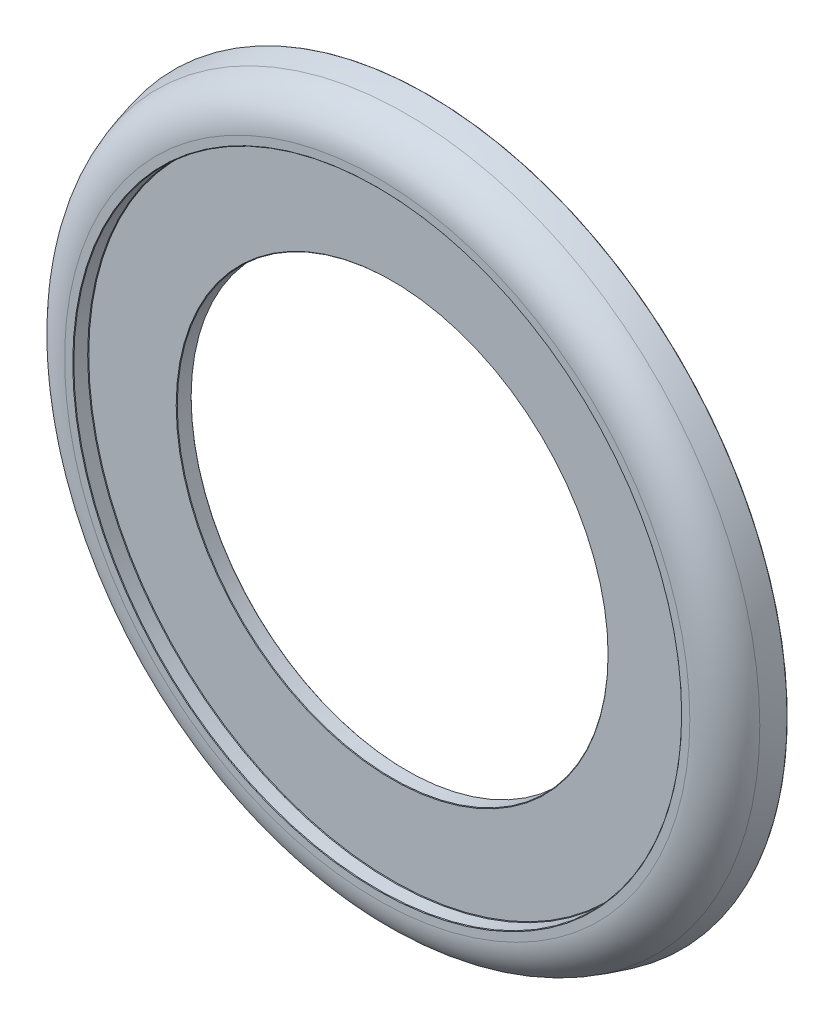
ISO-10303-21;
HEADER;
FILE_DESCRIPTION(('STEP AP214'),'2;1');
FILE_NAME('part.step','',(''),(''),'','','');
FILE_SCHEMA(('AUTOMOTIVE_DESIGN { 1 0 10303 214 1 1 1 1 }'));
ENDSEC;
DATA;
#1=APPLICATION_CONTEXT('core data for automotive mechanical design processes');
#2=APPLICATION_PROTOCOL_DEFINITION('international standard','automotive_design',2000,#1);
#3=PRODUCT_CONTEXT('',#1,'mechanical');
#4=PRODUCT('Part','Part','',(#3));
#5=PRODUCT_RELATED_PRODUCT_CATEGORY('part','',(#4));
#6=PRODUCT_DEFINITION_FORMATION('','',#4);
#7=PRODUCT_DEFINITION_CONTEXT('part definition',#1,'design');
#8=PRODUCT_DEFINITION('design','',#6,#7);
#9=PRODUCT_DEFINITION_SHAPE('','',#8);
#10=(LENGTH_UNIT() NAMED_UNIT(*) SI_UNIT(.MILLI.,.METRE.));
#11=(NAMED_UNIT(*) PLANE_ANGLE_UNIT() SI_UNIT($,.RADIAN.));
#12=(NAMED_UNIT(*) SI_UNIT($,.STERADIAN.) SOLID_ANGLE_UNIT());
#13=UNCERTAINTY_MEASURE_WITH_UNIT(LENGTH_MEASURE(1.E-05),#10,'distance_accuracy_value','');
#14=(GEOMETRIC_REPRESENTATION_CONTEXT(3) GLOBAL_UNCERTAINTY_ASSIGNED_CONTEXT((#13)) GLOBAL_UNIT_ASSIGNED_CONTEXT((#10,
#11,#12)) REPRESENTATION_CONTEXT('',''));
#15=CARTESIAN_POINT('',(0.,0.,0.));
#16=DIRECTION('',(0.,0.,1.));
#17=DIRECTION('',(1.,0.,0.));
#18=AXIS2_PLACEMENT_3D('',#15,#16,#17);
#19=CARTESIAN_POINT('',(0.,142.5,0.));
#20=DIRECTION('',(0.,0.,-1.));
#21=DIRECTION('',(-1.,0.,0.));
#22=AXIS2_PLACEMENT_3D('',#19,#20,#21);
#23=PLANE('',#22);
#24=CARTESIAN_POINT('',(0.,0.,0.));
#25=DIRECTION('',(0.,0.,-1.));
#26=DIRECTION('',(-1.,0.,0.));
#27=AXIS2_PLACEMENT_3D('',#24,#25,#26);
#28=CIRCLE('',#27,142.75);
#29=CARTESIAN_POINT('',(-142.75,0.,0.));
#30=VERTEX_POINT('',#29);
#31=EDGE_CURVE('E167',#30,#30,#28,.T.);
#32=ORIENTED_EDGE('',*,*,#31,.T.);
#33=EDGE_LOOP('',(#32));
#34=FACE_BOUND('',#33,.T.);
#35=CARTESIAN_POINT('',(0.,0.,0.));
#36=DIRECTION('',(0.,0.,1.));
#37=DIRECTION('',(1.,0.,0.));
#38=AXIS2_PLACEMENT_3D('',#35,#36,#37);
#39=CIRCLE('',#38,146.576527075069);
#40=CARTESIAN_POINT('',(146.576527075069,0.,0.));
#41=VERTEX_POINT('',#40);
#42=EDGE_CURVE('E146',#41,#41,#39,.T.);
#43=ORIENTED_EDGE('',*,*,#42,.T.);
#44=EDGE_LOOP('',(#43));
#45=FACE_BOUND('',#44,.T.);
#46=ADVANCED_FACE('F31',(#34,#45),#23,.F.);
#47=CARTESIAN_POINT('',(0.,0.,0.));
#48=DIRECTION('',(0.,0.,1.));
#49=DIRECTION('',(1.,0.,0.));
#50=AXIS2_PLACEMENT_3D('',#47,#48,#49);
#51=CYLINDRICAL_SURFACE('',#50,142.5);
#52=CARTESIAN_POINT('',(0.,0.,-0.250000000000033));
#53=DIRECTION('',(0.,0.,-1.));
#54=DIRECTION('',(-1.,0.,0.));
#55=AXIS2_PLACEMENT_3D('',#52,#53,#54);
#56=CIRCLE('',#55,142.5);
#57=CARTESIAN_POINT('',(-142.5,0.,-0.250000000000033));
#58=VERTEX_POINT('',#57);
#59=EDGE_CURVE('E164',#58,#58,#56,.F.);
#60=ORIENTED_EDGE('',*,*,#59,.T.);
#61=EDGE_LOOP('',(#60));
#62=FACE_BOUND('',#61,.T.);
#63=CARTESIAN_POINT('',(0.,0.,-6.74999999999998));
#64=DIRECTION('',(0.,0.,-1.));
#65=DIRECTION('',(-1.,0.,0.));
#66=AXIS2_PLACEMENT_3D('',#63,#64,#65);
#67=CIRCLE('',#66,142.5);
#68=CARTESIAN_POINT('',(-142.5,0.,-6.74999999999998));
#69=VERTEX_POINT('',#68);
#70=EDGE_CURVE('E161',#69,#69,#67,.T.);
#71=ORIENTED_EDGE('',*,*,#70,.T.);
#72=EDGE_LOOP('',(#71));
#73=FACE_BOUND('',#72,.T.);
#74=ADVANCED_FACE('F361',(#62,#73),#51,.F.);
#75=CARTESIAN_POINT('',(0.,142.5,-6.99999999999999));
#76=DIRECTION('',(0.,0.,-1.));
#77=DIRECTION('',(-1.,0.,0.));
#78=AXIS2_PLACEMENT_3D('',#75,#76,#77);
#79=PLANE('',#78);
#80=CARTESIAN_POINT('',(0.,0.,-6.99999999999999));
#81=DIRECTION('',(0.,0.,-1.));
#82=DIRECTION('',(-1.,0.,0.));
#83=AXIS2_PLACEMENT_3D('',#80,#81,#82);
#84=CIRCLE('',#83,142.25);
#85=CARTESIAN_POINT('',(-142.25,0.,-6.99999999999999));
#86=VERTEX_POINT('',#85);
#87=EDGE_CURVE('E173',#86,#86,#84,.F.);
#88=ORIENTED_EDGE('',*,*,#87,.T.);
#89=EDGE_LOOP('',(#88));
#90=FACE_BOUND('',#89,.T.);
#91=CARTESIAN_POINT('',(0.,0.,-6.99999999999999));
#92=DIRECTION('',(0.,0.,-1.));
#93=DIRECTION('',(-1.,0.,0.));
#94=AXIS2_PLACEMENT_3D('',#91,#92,#93);
#95=CIRCLE('',#94,101.25);
#96=CARTESIAN_POINT('',(-101.25,0.,-6.99999999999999));
#97=VERTEX_POINT('',#96);
#98=EDGE_CURVE('E170',#97,#97,#95,.T.);
#99=ORIENTED_EDGE('',*,*,#98,.T.);
#100=EDGE_LOOP('',(#99));
#101=FACE_BOUND('',#100,.T.);
#102=ADVANCED_FACE('F358',(#90,#101),#79,.F.);
#103=CARTESIAN_POINT('',(0.,0.,0.));
#104=DIRECTION('',(0.,0.,1.));
#105=DIRECTION('',(1.,0.,0.));
#106=AXIS2_PLACEMENT_3D('',#103,#104,#105);
#107=CYLINDRICAL_SURFACE('',#106,101.);
#108=CARTESIAN_POINT('',(0.,0.,-7.24999999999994));
#109=DIRECTION('',(0.,0.,-1.));
#110=DIRECTION('',(-1.,0.,0.));
#111=AXIS2_PLACEMENT_3D('',#108,#109,#110);
#112=CIRCLE('',#111,101.);
#113=CARTESIAN_POINT('',(-101.,0.,-7.24999999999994));
#114=VERTEX_POINT('',#113);
#115=EDGE_CURVE('E179',#114,#114,#112,.F.);
#116=ORIENTED_EDGE('',*,*,#115,.T.);
#117=EDGE_LOOP('',(#116));
#118=FACE_BOUND('',#117,.T.);
#119=CARTESIAN_POINT('',(0.,0.,-13.75));
#120=DIRECTION('',(0.,0.,1.));
#121=DIRECTION('',(1.,0.,0.));
#122=AXIS2_PLACEMENT_3D('',#119,#120,#121);
#123=CIRCLE('',#122,101.);
#124=CARTESIAN_POINT('',(101.,0.,-13.75));
#125=VERTEX_POINT('',#124);
#126=EDGE_CURVE('E176',#125,#125,#123,.F.);
#127=ORIENTED_EDGE('',*,*,#126,.T.);
#128=EDGE_LOOP('',(#127));
#129=FACE_BOUND('',#128,.T.);
#130=ADVANCED_FACE('F354',(#118,#129),#107,.F.);
#131=CARTESIAN_POINT('',(0.,101.,-14.));
#132=DIRECTION('',(0.,0.,1.));
#133=DIRECTION('',(1.,0.,0.));
#134=AXIS2_PLACEMENT_3D('',#131,#132,#133);
#135=PLANE('',#134);
#136=CARTESIAN_POINT('',(0.,0.,-14.));
#137=DIRECTION('',(0.,0.,1.));
#138=DIRECTION('',(1.,0.,0.));
#139=AXIS2_PLACEMENT_3D('',#136,#137,#138);
#140=CIRCLE('',#139,101.25);
#141=CARTESIAN_POINT('',(101.25,0.,-14.));
#142=VERTEX_POINT('',#141);
#143=EDGE_CURVE('E185',#142,#142,#140,.T.);
#144=ORIENTED_EDGE('',*,*,#143,.T.);
#145=EDGE_LOOP('',(#144));
#146=FACE_BOUND('',#145,.T.);
#147=CARTESIAN_POINT('',(0.,0.,-14.));
#148=DIRECTION('',(0.,0.,1.));
#149=DIRECTION('',(1.,0.,0.));
#150=AXIS2_PLACEMENT_3D('',#147,#148,#149);
#151=CIRCLE('',#150,155.75);
#152=CARTESIAN_POINT('',(155.75,0.,-14.));
#153=VERTEX_POINT('',#152);
#154=EDGE_CURVE('E182',#153,#153,#151,.F.);
#155=ORIENTED_EDGE('',*,*,#154,.T.);
#156=EDGE_LOOP('',(#155));
#157=FACE_BOUND('',#156,.T.);
#158=ADVANCED_FACE('F349',(#146,#157),#135,.F.);
#159=CARTESIAN_POINT('',(0.,0.,0.));
#160=DIRECTION('',(0.,0.,1.));
#161=DIRECTION('',(1.,0.,0.));
#162=AXIS2_PLACEMENT_3D('',#159,#160,#161);
#163=CYLINDRICAL_SURFACE('',#162,156.);
#164=CARTESIAN_POINT('',(0.,0.,-14.2499999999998));
#165=DIRECTION('',(0.,0.,1.));
#166=DIRECTION('',(1.,0.,0.));
#167=AXIS2_PLACEMENT_3D('',#164,#165,#166);
#168=CIRCLE('',#167,156.);
#169=CARTESIAN_POINT('',(156.,0.,-14.2499999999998));
#170=VERTEX_POINT('',#169);
#171=EDGE_CURVE('E212',#170,#170,#168,.T.);
#172=ORIENTED_EDGE('',*,*,#171,.T.);
#173=EDGE_LOOP('',(#172));
#174=FACE_BOUND('',#173,.T.);
#175=DIRECTION('',(0.,0.,1.));
#176=VECTOR('',#175,1.);
#177=CARTESIAN_POINT('',(-153.03989746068,-30.2454919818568,0.));
#178=LINE('',#177,#176);
#179=CARTESIAN_POINT('',(-153.03989746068,-30.2454919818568,-23.75));
#180=VERTEX_POINT('',#179);
#181=CARTESIAN_POINT('',(-153.03989746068,-30.2454919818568,-21.2500000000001));
#182=VERTEX_POINT('',#181);
#183=EDGE_CURVE('E205',#180,#182,#178,.T.);
#184=ORIENTED_EDGE('',*,*,#183,.T.);
#185=CARTESIAN_POINT('',(-153.146228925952,-29.7023999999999,-20.7499999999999));
#186=CARTESIAN_POINT('',(-153.135877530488,-29.7557720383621,-20.7992163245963));
#187=CARTESIAN_POINT('',(-153.125495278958,-29.8091538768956,-20.8484155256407));
#188=CARTESIAN_POINT('',(-153.104669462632,-29.9159346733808,-20.9467823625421));
#189=CARTESIAN_POINT('',(-153.094225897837,-29.9693336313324,-20.9959499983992));
#190=CARTESIAN_POINT('',(-153.069192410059,-30.096977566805,-21.1134288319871));
#191=CARTESIAN_POINT('',(-153.054574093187,-30.1712293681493,-21.1817265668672));
#192=CARTESIAN_POINT('',(-153.03989746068,-30.2454919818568,-21.2500000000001));
#193=B_SPLINE_CURVE_WITH_KNOTS('',3,(#185,#186,#187,#188,#189,#190,#191,#192),.UNSPECIFIED.,.F.,
.F.,(4,2,2,4),(0.,0.220003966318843,0.440007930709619,0.745825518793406),.UNSPECIFIED.);
#194=CARTESIAN_POINT('',(-153.146228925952,-29.7023999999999,-20.7499999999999));
#195=VERTEX_POINT('',#194);
#196=EDGE_CURVE('E340',#182,#195,#193,.F.);
#197=ORIENTED_EDGE('',*,*,#196,.T.);
#198=CARTESIAN_POINT('',(0.,0.,-20.7499999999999));
#199=DIRECTION('',(0.,0.,-1.));
#200=DIRECTION('',(-1.,0.,0.));
#201=AXIS2_PLACEMENT_3D('',#198,#199,#200);
#202=CIRCLE('',#201,156.);
#203=CARTESIAN_POINT('',(-153.146228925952,29.7023999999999,-20.7499999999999));
#204=VERTEX_POINT('',#203);
#205=EDGE_CURVE('E210',#195,#204,#202,.T.);
#206=ORIENTED_EDGE('',*,*,#205,.T.);
#207=CARTESIAN_POINT('',(-153.03989746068,30.2454919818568,-21.2500000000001));
#208=CARTESIAN_POINT('',(-153.050455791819,30.1920676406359,-21.2008844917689));
#209=CARTESIAN_POINT('',(-153.060983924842,30.138648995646,-21.1517562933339));
#210=CARTESIAN_POINT('',(-153.08197941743,30.0318254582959,-21.0534719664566));
#211=CARTESIAN_POINT('',(-153.092446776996,29.9784205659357,-21.0043158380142));
#212=CARTESIAN_POINT('',(-153.117391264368,29.8507991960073,-20.8867935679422));
#213=CARTESIAN_POINT('',(-153.131839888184,29.7765902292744,-20.8184132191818));
#214=CARTESIAN_POINT('',(-153.146228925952,29.7023999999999,-20.7499999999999));
#215=B_SPLINE_CURVE_WITH_KNOTS('',3,(#207,#208,#209,#210,#211,#212,#213,#214),.UNSPECIFIED.,.F.,
.F.,(4,2,2,4),(0.,0.220003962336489,0.440007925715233,0.745825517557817),.UNSPECIFIED.);
#216=CARTESIAN_POINT('',(-153.03989746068,30.2454919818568,-21.2500000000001));
#217=VERTEX_POINT('',#216);
#218=EDGE_CURVE('E335',#204,#217,#215,.F.);
#219=ORIENTED_EDGE('',*,*,#218,.T.);
#220=DIRECTION('',(0.,0.,1.));
#221=VECTOR('',#220,1.);
#222=CARTESIAN_POINT('',(-153.03989746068,30.2454919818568,0.));
#223=LINE('',#222,#221);
#224=CARTESIAN_POINT('',(-153.03989746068,30.2454919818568,-23.75));
#225=VERTEX_POINT('',#224);
#226=EDGE_CURVE('E207',#217,#225,#223,.F.);
#227=ORIENTED_EDGE('',*,*,#226,.T.);
#228=CARTESIAN_POINT('',(0.,0.,-23.75));
#229=DIRECTION('',(0.,0.,1.));
#230=DIRECTION('',(1.,0.,0.));
#231=AXIS2_PLACEMENT_3D('',#228,#229,#230);
#232=CIRCLE('',#231,156.);
#233=EDGE_CURVE('E203',#225,#180,#232,.F.);
#234=ORIENTED_EDGE('',*,*,#233,.T.);
#235=EDGE_LOOP('',(#184,#197,#206,#219,#227,#234));
#236=FACE_BOUND('',#235,.T.);
#237=ADVANCED_FACE('F345',(#174,#236),#163,.F.);
#238=CARTESIAN_POINT('',(0.,156.,-24.));
#239=DIRECTION('',(0.,0.,1.));
#240=DIRECTION('',(1.,0.,0.));
#241=AXIS2_PLACEMENT_3D('',#238,#239,#240);
#242=PLANE('',#241);
#243=CARTESIAN_POINT('',(160.73,0.,-24.));
#244=DIRECTION('',(0.,0.,1.));
#245=DIRECTION('',(1.,0.,0.));
#246=AXIS2_PLACEMENT_3D('',#243,#244,#245);
#247=CIRCLE('',#246,2.24999999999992);
#248=CARTESIAN_POINT('',(162.98,0.,-24.));
#249=VERTEX_POINT('',#248);
#250=EDGE_CURVE('E200',#249,#249,#247,.T.);
#251=ORIENTED_EDGE('',*,*,#250,.T.);
#252=EDGE_LOOP('',(#251));
#253=FACE_BOUND('',#252,.T.);
#254=DIRECTION('',(-1.,0.,0.));
#255=VECTOR('',#254,1.);
#256=CARTESIAN_POINT('',(0.,30.25,-24.));
#257=LINE('',#256,#255);
#258=CARTESIAN_POINT('',(-153.293835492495,30.25,-24.));
#259=VERTEX_POINT('',#258);
#260=CARTESIAN_POINT('',(-165.498878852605,30.25,-24.));
#261=VERTEX_POINT('',#260);
#262=EDGE_CURVE('E195',#259,#261,#257,.T.);
#263=ORIENTED_EDGE('',*,*,#262,.T.);
#264=CARTESIAN_POINT('',(0.,0.,-24.));
#265=DIRECTION('',(0.,0.,1.));
#266=DIRECTION('',(1.,0.,0.));
#267=AXIS2_PLACEMENT_3D('',#264,#265,#266);
#268=CIRCLE('',#267,168.240724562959);
#269=CARTESIAN_POINT('',(-165.498878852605,-30.25,-24.));
#270=VERTEX_POINT('',#269);
#271=EDGE_CURVE('E197',#261,#270,#268,.F.);
#272=ORIENTED_EDGE('',*,*,#271,.T.);
#273=DIRECTION('',(1.,0.,0.));
#274=VECTOR('',#273,1.);
#275=CARTESIAN_POINT('',(0.,-30.25,-24.));
#276=LINE('',#275,#274);
#277=CARTESIAN_POINT('',(-153.293835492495,-30.25,-24.));
#278=VERTEX_POINT('',#277);
#279=EDGE_CURVE('E193',#270,#278,#276,.T.);
#280=ORIENTED_EDGE('',*,*,#279,.T.);
#281=CARTESIAN_POINT('',(0.,0.,-24.));
#282=DIRECTION('',(0.,0.,1.));
#283=DIRECTION('',(1.,0.,0.));
#284=AXIS2_PLACEMENT_3D('',#281,#282,#283);
#285=CIRCLE('',#284,156.25);
#286=EDGE_CURVE('E191',#278,#259,#285,.T.);
#287=ORIENTED_EDGE('',*,*,#286,.T.);
#288=EDGE_LOOP('',(#263,#272,#280,#287));
#289=FACE_BOUND('',#288,.T.);
#290=ADVANCED_FACE('F237',(#253,#289),#242,.F.);
#291=CARTESIAN_POINT('',(0.,0.,-52.5));
#292=DIRECTION('',(0.,0.,1.));
#293=DIRECTION('',(1.,0.,0.));
#294=AXIS2_PLACEMENT_3D('',#291,#292,#293);
#295=DEGENERATE_TOROIDAL_SURFACE('',#294,47.08,124.67,.T.);
#296=CARTESIAN_POINT('',(0.,0.,-23.7569208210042));
#297=DIRECTION('',(0.,0.,-1.));
#298=DIRECTION('',(-1.,0.,0.));
#299=AXIS2_PLACEMENT_3D('',#296,#297,#298);
#300=CIRCLE('',#299,168.391352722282);
#301=CARTESIAN_POINT('',(-165.652724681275,-30.2460324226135,-23.7569208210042));
#302=VERTEX_POINT('',#301);
#303=CARTESIAN_POINT('',(-165.652724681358,30.2460324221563,-23.7569208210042));
#304=VERTEX_POINT('',#303);
#305=EDGE_CURVE('E215',#302,#304,#300,.F.);
#306=ORIENTED_EDGE('',*,*,#305,.T.);
#307=CARTESIAN_POINT('',(-164.921447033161,30.2459816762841,-20.8744421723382));
#308=CARTESIAN_POINT('',(-165.18856126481,30.2460003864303,-21.8762229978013));
#309=CARTESIAN_POINT('',(-165.4440570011,30.2460181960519,-22.8857234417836));
#310=CARTESIAN_POINT('',(-165.685778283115,30.246034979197,-23.8945061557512));
#311=B_SPLINE_CURVE_WITH_KNOTS('',3,(#307,#308,#309,#310),.UNSPECIFIED.,.F.,.F.,(4,4),
(0.0397530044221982,0.0428230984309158),.UNSPECIFIED.);
#312=CARTESIAN_POINT('',(-165.009365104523,30.2459861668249,-21.2060474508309));
#313=VERTEX_POINT('',#312);
#314=EDGE_CURVE('E683',#304,#313,#311,.F.);
#315=ORIENTED_EDGE('',*,*,#314,.T.);
#316=CARTESIAN_POINT('',(-164.970293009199,29.7800803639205,-20.7399634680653));
#317=CARTESIAN_POINT('',(-164.976998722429,29.8578822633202,-20.8174760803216));
#318=CARTESIAN_POINT('',(-164.983604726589,29.935615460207,-20.8950662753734));
#319=CARTESIAN_POINT('',(-164.993370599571,30.0520969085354,-21.0115823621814));
#320=CARTESIAN_POINT('',(-164.996602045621,30.090904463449,-21.0504429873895));
#321=CARTESIAN_POINT('',(-165.003018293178,30.1684775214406,-21.1282101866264));
#322=CARTESIAN_POINT('',(-165.006203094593,30.2072430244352,-21.1671167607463));
#323=CARTESIAN_POINT('',(-165.009365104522,30.2459861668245,-21.2060474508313));
#324=B_SPLINE_CURVE_WITH_KNOTS('',3,(#316,#317,#318,#319,#320,#321,#322,#323),.UNSPECIFIED.,.F.,
.F.,(4,2,2,4),(0.,0.330085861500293,0.495129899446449,0.660174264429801),.UNSPECIFIED.);
#325=CARTESIAN_POINT('',(-164.970293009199,29.7800803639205,-20.7399634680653));
#326=VERTEX_POINT('',#325);
#327=EDGE_CURVE('E288',#326,#313,#324,.T.);
#328=ORIENTED_EDGE('',*,*,#327,.F.);
#329=CARTESIAN_POINT('',(0.,0.,-20.7399634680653));
#330=DIRECTION('',(0.,0.,-1.));
#331=DIRECTION('',(-1.,0.,0.));
#332=AXIS2_PLACEMENT_3D('',#329,#330,#331);
#333=CIRCLE('',#332,167.636662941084);
#334=CARTESIAN_POINT('',(-164.970293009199,-29.7800803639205,-20.7399634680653));
#335=VERTEX_POINT('',#334);
#336=EDGE_CURVE('E258',#326,#335,#333,.F.);
#337=ORIENTED_EDGE('',*,*,#336,.T.);
#338=CARTESIAN_POINT('',(-165.009365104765,-30.245986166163,-21.2060474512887));
#339=CARTESIAN_POINT('',(-165.003041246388,-30.168500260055,-21.1281869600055));
#340=CARTESIAN_POINT('',(-164.996626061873,-30.090925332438,-21.0504225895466));
#341=CARTESIAN_POINT('',(-164.986860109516,-29.9744440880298,-20.9339063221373));
#342=CARTESIAN_POINT('',(-164.983580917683,-29.9355970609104,-20.8950891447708));
#343=CARTESIAN_POINT('',(-164.976973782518,-29.8578659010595,-20.8174959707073));
#344=CARTESIAN_POINT('',(-164.973645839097,-29.8189817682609,-20.7787199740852));
#345=CARTESIAN_POINT('',(-164.970293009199,-29.7800803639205,-20.7399634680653));
#346=B_SPLINE_CURVE_WITH_KNOTS('',3,(#338,#339,#340,#341,#342,#343,#344,#345),.UNSPECIFIED.,.F.,
.F.,(4,2,2,4),(0.,0.330085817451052,0.495129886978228,0.66017425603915),.UNSPECIFIED.);
#347=CARTESIAN_POINT('',(-165.009364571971,-30.2459873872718,-21.2060462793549));
#348=VERTEX_POINT('',#347);
#349=EDGE_CURVE('E257',#348,#335,#346,.T.);
#350=ORIENTED_EDGE('',*,*,#349,.F.);
#351=CARTESIAN_POINT('',(-165.685778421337,-30.2460349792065,-23.8945067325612));
#352=CARTESIAN_POINT('',(-165.444055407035,-30.246018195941,-22.8857168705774));
#353=CARTESIAN_POINT('',(-165.188560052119,-30.2460003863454,-21.8762184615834));
#354=CARTESIAN_POINT('',(-164.921447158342,-30.2459816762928,-20.8744426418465));
#355=B_SPLINE_CURVE_WITH_KNOTS('',3,(#351,#352,#353,#354),.UNSPECIFIED.,.F.,.F.,(4,4),
(0.039670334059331,0.0427401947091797),.UNSPECIFIED.);
#356=EDGE_CURVE('E219',#348,#302,#355,.F.);
#357=ORIENTED_EDGE('',*,*,#356,.T.);
#358=EDGE_LOOP('',(#306,#315,#328,#337,#350,#357));
#359=FACE_BOUND('',#358,.T.);
#360=CARTESIAN_POINT('',(0.,0.,-13.7900066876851));
#361=DIRECTION('',(0.,0.,1.));
#362=DIRECTION('',(1.,0.,0.));
#363=AXIS2_PLACEMENT_3D('',#360,#361,#362);
#364=CIRCLE('',#363,165.587996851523);
#365=CARTESIAN_POINT('',(165.587996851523,0.,-13.7900066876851));
#366=VERTEX_POINT('',#365);
#367=EDGE_CURVE('E150',#366,#366,#364,.T.);
#368=ORIENTED_EDGE('',*,*,#367,.F.);
#369=EDGE_LOOP('',(#368));
#370=FACE_BOUND('',#369,.T.);
#371=ADVANCED_FACE('F226',(#359,#370),#295,.T.);
#372=CARTESIAN_POINT('',(0.,0.,-20.));
#373=DIRECTION('',(0.,0.,1.));
#374=DIRECTION('',(1.,0.,0.));
#375=AXIS2_PLACEMENT_3D('',#372,#373,#374);
#376=TOROIDAL_SURFACE('',#375,146.576527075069,20.);
#377=ORIENTED_EDGE('',*,*,#42,.F.);
#378=EDGE_LOOP('',(#377));
#379=FACE_BOUND('',#378,.T.);
#380=ORIENTED_EDGE('',*,*,#367,.T.);
#381=EDGE_LOOP('',(#380));
#382=FACE_BOUND('',#381,.T.);
#383=ADVANCED_FACE('F236',(#379,#382),#376,.T.);
#384=CARTESIAN_POINT('',(0.,30.,-21.));
#385=DIRECTION('',(0.,1.,0.));
#386=DIRECTION('',(0.,0.,1.));
#387=AXIS2_PLACEMENT_3D('',#384,#385,#386);
#388=PLANE('',#387);
#389=DIRECTION('',(0.,0.,1.));
#390=VECTOR('',#389,1.);
#391=CARTESIAN_POINT('',(-153.405055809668,30.,-21.));
#392=LINE('',#391,#390);
#393=CARTESIAN_POINT('',(-153.405055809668,30.,-23.75));
#394=VERTEX_POINT('',#393);
#395=CARTESIAN_POINT('',(-153.405055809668,30.,-21.2500000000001));
#396=VERTEX_POINT('',#395);
#397=EDGE_CURVE('E289',#394,#396,#392,.T.);
#398=ORIENTED_EDGE('',*,*,#397,.T.);
#399=DIRECTION('',(-1.,0.,0.));
#400=VECTOR('',#399,1.);
#401=CARTESIAN_POINT('',(0.,30.,-21.2500000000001));
#402=LINE('',#401,#400);
#403=CARTESIAN_POINT('',(-164.842646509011,30.,-21.249999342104));
#404=VERTEX_POINT('',#403);
#405=EDGE_CURVE('E820',#396,#404,#402,.T.);
#406=ORIENTED_EDGE('',*,*,#405,.T.);
#407=CARTESIAN_POINT('',(-165.518116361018,30.,-23.9346837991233));
#408=CARTESIAN_POINT('',(-165.276731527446,30.,-22.9273179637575));
#409=CARTESIAN_POINT('',(-165.021591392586,30.,-21.9192354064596));
#410=CARTESIAN_POINT('',(-164.754848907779,30.,-20.9188616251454));
#411=B_SPLINE_CURVE_WITH_KNOTS('',3,(#407,#408,#409,#410),.UNSPECIFIED.,.F.,.F.,(4,4),
(0.0397530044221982,0.0428230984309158),.UNSPECIFIED.);
#412=CARTESIAN_POINT('',(-165.47371020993,30.,-23.75));
#413=VERTEX_POINT('',#412);
#414=EDGE_CURVE('E291',#404,#413,#411,.F.);
#415=ORIENTED_EDGE('',*,*,#414,.T.);
#416=DIRECTION('',(1.,0.,0.));
#417=VECTOR('',#416,1.);
#418=CARTESIAN_POINT('',(0.,30.,-23.75));
#419=LINE('',#418,#417);
#420=EDGE_CURVE('E292',#413,#394,#419,.T.);
#421=ORIENTED_EDGE('',*,*,#420,.T.);
#422=EDGE_LOOP('',(#398,#406,#415,#421));
#423=FACE_BOUND('',#422,.T.);
#424=ADVANCED_FACE('F302',(#423),#388,.F.);
#425=CARTESIAN_POINT('',(0.,-30.,-21.));
#426=DIRECTION('',(0.,-1.,0.));
#427=DIRECTION('',(0.,0.,-1.));
#428=AXIS2_PLACEMENT_3D('',#425,#426,#427);
#429=PLANE('',#428);
#430=DIRECTION('',(-1.,0.,0.));
#431=VECTOR('',#430,1.);
#432=CARTESIAN_POINT('',(0.,-30.,-23.75));
#433=LINE('',#432,#431);
#434=CARTESIAN_POINT('',(-153.405055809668,-30.,-23.75));
#435=VERTEX_POINT('',#434);
#436=CARTESIAN_POINT('',(-165.473710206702,-30.,-23.75));
#437=VERTEX_POINT('',#436);
#438=EDGE_CURVE('E320',#435,#437,#433,.T.);
#439=ORIENTED_EDGE('',*,*,#438,.T.);
#440=CARTESIAN_POINT('',(-164.754849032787,-30.,-20.9188620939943));
#441=CARTESIAN_POINT('',(-165.021590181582,-30.,-21.919230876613));
#442=CARTESIAN_POINT('',(-165.2767299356,-30.,-22.9273114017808));
#443=CARTESIAN_POINT('',(-165.518116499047,-30.,-23.9346843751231));
#444=B_SPLINE_CURVE_WITH_KNOTS('',3,(#440,#441,#442,#443),.UNSPECIFIED.,.F.,.F.,(4,4),
(0.039670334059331,0.0427401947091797),.UNSPECIFIED.);
#445=CARTESIAN_POINT('',(-164.842646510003,-30.,-21.2500000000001));
#446=VERTEX_POINT('',#445);
#447=EDGE_CURVE('E332',#437,#446,#444,.F.);
#448=ORIENTED_EDGE('',*,*,#447,.T.);
#449=DIRECTION('',(1.,0.,0.));
#450=VECTOR('',#449,1.);
#451=CARTESIAN_POINT('',(0.,-30.,-21.2500000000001));
#452=LINE('',#451,#450);
#453=CARTESIAN_POINT('',(-153.405055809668,-30.,-21.2500000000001));
#454=VERTEX_POINT('',#453);
#455=EDGE_CURVE('E54',#446,#454,#452,.T.);
#456=ORIENTED_EDGE('',*,*,#455,.T.);
#457=DIRECTION('',(0.,0.,-1.));
#458=VECTOR('',#457,1.);
#459=CARTESIAN_POINT('',(-153.405055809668,-30.,-21.));
#460=LINE('',#459,#458);
#461=EDGE_CURVE('E327',#454,#435,#460,.T.);
#462=ORIENTED_EDGE('',*,*,#461,.T.);
#463=EDGE_LOOP('',(#439,#448,#456,#462));
#464=FACE_BOUND('',#463,.T.);
#465=ADVANCED_FACE('F311',(#464),#429,.F.);
#466=CARTESIAN_POINT('',(0.,-30.,-21.));
#467=DIRECTION('',(0.,0.,-1.));
#468=DIRECTION('',(-1.,0.,0.));
#469=AXIS2_PLACEMENT_3D('',#466,#467,#468);
#470=PLANE('',#469);
#471=CARTESIAN_POINT('',(-159.136662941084,-20.,-21.));
#472=DIRECTION('',(0.,0.,-1.));
#473=DIRECTION('',(-1.,0.,0.));
#474=AXIS2_PLACEMENT_3D('',#471,#472,#473);
#475=CIRCLE('',#474,1.06250000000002);
#476=CARTESIAN_POINT('',(-160.199162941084,-20.,-21.));
#477=VERTEX_POINT('',#476);
#478=EDGE_CURVE('E440',#477,#477,#475,.F.);
#479=ORIENTED_EDGE('',*,*,#478,.T.);
#480=EDGE_LOOP('',(#479));
#481=FACE_BOUND('',#480,.T.);
#482=CARTESIAN_POINT('',(-159.136662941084,0.,-21.));
#483=DIRECTION('',(0.,0.,-1.));
#484=DIRECTION('',(-1.,0.,0.));
#485=AXIS2_PLACEMENT_3D('',#482,#483,#484);
#486=CIRCLE('',#485,1.06250000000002);
#487=CARTESIAN_POINT('',(-160.199162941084,0.,-21.));
#488=VERTEX_POINT('',#487);
#489=EDGE_CURVE('E430',#488,#488,#486,.F.);
#490=ORIENTED_EDGE('',*,*,#489,.T.);
#491=EDGE_LOOP('',(#490));
#492=FACE_BOUND('',#491,.T.);
#493=CARTESIAN_POINT('',(-159.136662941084,20.,-21.));
#494=DIRECTION('',(0.,0.,-1.));
#495=DIRECTION('',(-1.,0.,0.));
#496=AXIS2_PLACEMENT_3D('',#493,#494,#495);
#497=CIRCLE('',#496,1.06250000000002);
#498=CARTESIAN_POINT('',(-160.199162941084,20.,-21.));
#499=VERTEX_POINT('',#498);
#500=EDGE_CURVE('E425',#499,#499,#497,.F.);
#501=ORIENTED_EDGE('',*,*,#500,.T.);
#502=EDGE_LOOP('',(#501));
#503=FACE_BOUND('',#502,.T.);
#504=DIRECTION('',(-1.,0.,0.));
#505=VECTOR('',#504,1.);
#506=CARTESIAN_POINT('',(0.,-29.7499999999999,-21.));
#507=LINE('',#506,#505);
#508=CARTESIAN_POINT('',(-153.391655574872,-29.7499999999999,-21.));
#509=VERTEX_POINT('',#508);
#510=CARTESIAN_POINT('',(-164.803659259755,-29.7499999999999,-21.));
#511=VERTEX_POINT('',#510);
#512=EDGE_CURVE('E811',#509,#511,#507,.T.);
#513=ORIENTED_EDGE('',*,*,#512,.T.);
#514=CARTESIAN_POINT('',(0.,0.,-21.));
#515=DIRECTION('',(0.,0.,-1.));
#516=DIRECTION('',(-1.,0.,0.));
#517=AXIS2_PLACEMENT_3D('',#514,#515,#516);
#518=CIRCLE('',#517,167.467335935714);
#519=CARTESIAN_POINT('',(-164.803659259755,29.7499999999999,-21.));
#520=VERTEX_POINT('',#519);
#521=EDGE_CURVE('E328',#511,#520,#518,.T.);
#522=ORIENTED_EDGE('',*,*,#521,.T.);
#523=DIRECTION('',(1.,0.,0.));
#524=VECTOR('',#523,1.);
#525=CARTESIAN_POINT('',(0.,29.7499999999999,-21.));
#526=LINE('',#525,#524);
#527=CARTESIAN_POINT('',(-153.391655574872,29.7499999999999,-21.));
#528=VERTEX_POINT('',#527);
#529=EDGE_CURVE('E814',#520,#528,#526,.T.);
#530=ORIENTED_EDGE('',*,*,#529,.T.);
#531=CARTESIAN_POINT('',(0.,0.,-21.));
#532=DIRECTION('',(0.,0.,-1.));
#533=DIRECTION('',(-1.,0.,0.));
#534=AXIS2_PLACEMENT_3D('',#531,#532,#533);
#535=CIRCLE('',#534,156.25);
#536=EDGE_CURVE('E809',#528,#509,#535,.F.);
#537=ORIENTED_EDGE('',*,*,#536,.T.);
#538=EDGE_LOOP('',(#513,#522,#530,#537));
#539=FACE_BOUND('',#538,.T.);
#540=ADVANCED_FACE('F140',(#481,#492,#503,#539),#470,.T.);
#541=CARTESIAN_POINT('',(160.73,0.,-13.));
#542=DIRECTION('',(0.,0.,-1.));
#543=DIRECTION('',(-1.,0.,0.));
#544=AXIS2_PLACEMENT_3D('',#541,#542,#543);
#545=CONICAL_SURFACE('',#544,2.,1.02974425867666);
#546=CARTESIAN_POINT('',(160.73,0.,-11.7982787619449));
#547=VERTEX_POINT('',#546);
#548=VERTEX_LOOP('',#547);
#549=FACE_BOUND('',#548,.T.);
#550=CARTESIAN_POINT('',(160.73,0.,-13.));
#551=DIRECTION('',(0.,0.,-1.));
#552=DIRECTION('',(-1.,0.,0.));
#553=AXIS2_PLACEMENT_3D('',#550,#551,#552);
#554=CIRCLE('',#553,2.);
#555=CARTESIAN_POINT('',(158.73,0.,-13.));
#556=VERTEX_POINT('',#555);
#557=EDGE_CURVE('E144',#556,#556,#554,.T.);
#558=ORIENTED_EDGE('',*,*,#557,.T.);
#559=EDGE_LOOP('',(#558));
#560=FACE_BOUND('',#559,.T.);
#561=ADVANCED_FACE('F136',(#549,#560),#545,.F.);
#562=CARTESIAN_POINT('',(160.73,0.,-24.));
#563=DIRECTION('',(0.,0.,-1.));
#564=DIRECTION('',(-1.,0.,0.));
#565=AXIS2_PLACEMENT_3D('',#562,#563,#564);
#566=CYLINDRICAL_SURFACE('',#565,2.);
#567=CARTESIAN_POINT('',(160.73,0.,-23.7500000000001));
#568=DIRECTION('',(0.,0.,1.));
#569=DIRECTION('',(1.,0.,0.));
#570=AXIS2_PLACEMENT_3D('',#567,#568,#569);
#571=CIRCLE('',#570,2.);
#572=CARTESIAN_POINT('',(162.73,0.,-23.7500000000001));
#573=VERTEX_POINT('',#572);
#574=EDGE_CURVE('E188',#573,#573,#571,.F.);
#575=ORIENTED_EDGE('',*,*,#574,.T.);
#576=EDGE_LOOP('',(#575));
#577=FACE_BOUND('',#576,.T.);
#578=ORIENTED_EDGE('',*,*,#557,.F.);
#579=EDGE_LOOP('',(#578));
#580=FACE_BOUND('',#579,.T.);
#581=ADVANCED_FACE('F139',(#577,#580),#566,.F.);
#582=CARTESIAN_POINT('',(0.,0.,-0.250000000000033));
#583=DIRECTION('',(0.,0.,1.));
#584=DIRECTION('',(1.,0.,0.));
#585=AXIS2_PLACEMENT_3D('',#582,#583,#584);
#586=CONICAL_SURFACE('',#585,142.5,0.785398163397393);
#587=ORIENTED_EDGE('',*,*,#31,.F.);
#588=EDGE_LOOP('',(#587));
#589=FACE_BOUND('',#588,.T.);
#590=ORIENTED_EDGE('',*,*,#59,.F.);
#591=EDGE_LOOP('',(#590));
#592=FACE_BOUND('',#591,.T.);
#593=ADVANCED_FACE('F377',(#589,#592),#586,.F.);
#594=CARTESIAN_POINT('',(0.,0.,-6.99999999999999));
#595=DIRECTION('',(0.,0.,1.));
#596=DIRECTION('',(1.,0.,0.));
#597=AXIS2_PLACEMENT_3D('',#594,#595,#596);
#598=CONICAL_SURFACE('',#597,142.25,0.785398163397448);
#599=ORIENTED_EDGE('',*,*,#70,.F.);
#600=EDGE_LOOP('',(#599));
#601=FACE_BOUND('',#600,.T.);
#602=ORIENTED_EDGE('',*,*,#87,.F.);
#603=EDGE_LOOP('',(#602));
#604=FACE_BOUND('',#603,.T.);
#605=ADVANCED_FACE('F373',(#601,#604),#598,.F.);
#606=CARTESIAN_POINT('',(0.,0.,-7.24999999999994));
#607=DIRECTION('',(0.,0.,1.));
#608=DIRECTION('',(1.,0.,0.));
#609=AXIS2_PLACEMENT_3D('',#606,#607,#608);
#610=CONICAL_SURFACE('',#609,101.,0.785398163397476);
#611=ORIENTED_EDGE('',*,*,#98,.F.);
#612=EDGE_LOOP('',(#611));
#613=FACE_BOUND('',#612,.T.);
#614=ORIENTED_EDGE('',*,*,#115,.F.);
#615=EDGE_LOOP('',(#614));
#616=FACE_BOUND('',#615,.T.);
#617=ADVANCED_FACE('F376',(#613,#616),#610,.F.);
#618=CARTESIAN_POINT('',(0.,0.,-14.));
#619=DIRECTION('',(0.,0.,-1.));
#620=DIRECTION('',(-1.,0.,0.));
#621=AXIS2_PLACEMENT_3D('',#618,#619,#620);
#622=CONICAL_SURFACE('',#621,101.25,0.785398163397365);
#623=ORIENTED_EDGE('',*,*,#126,.F.);
#624=EDGE_LOOP('',(#623));
#625=FACE_BOUND('',#624,.T.);
#626=ORIENTED_EDGE('',*,*,#143,.F.);
#627=EDGE_LOOP('',(#626));
#628=FACE_BOUND('',#627,.T.);
#629=ADVANCED_FACE('F385',(#625,#628),#622,.F.);
#630=CARTESIAN_POINT('',(160.73,0.,-23.7500000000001));
#631=DIRECTION('',(0.,0.,-1.));
#632=DIRECTION('',(-1.,0.,0.));
#633=AXIS2_PLACEMENT_3D('',#630,#631,#632);
#634=CONICAL_SURFACE('',#633,2.,0.785398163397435);
#635=ORIENTED_EDGE('',*,*,#250,.F.);
#636=EDGE_LOOP('',(#635));
#637=FACE_BOUND('',#636,.T.);
#638=ORIENTED_EDGE('',*,*,#574,.F.);
#639=EDGE_LOOP('',(#638));
#640=FACE_BOUND('',#639,.T.);
#641=ADVANCED_FACE('F393',(#637,#640),#634,.F.);
#642=CARTESIAN_POINT('',(0.,0.,-14.2499999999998));
#643=DIRECTION('',(0.,0.,-1.));
#644=DIRECTION('',(-1.,0.,0.));
#645=AXIS2_PLACEMENT_3D('',#642,#643,#644);
#646=CONICAL_SURFACE('',#645,156.,0.785398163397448);
#647=ORIENTED_EDGE('',*,*,#154,.F.);
#648=EDGE_LOOP('',(#647));
#649=FACE_BOUND('',#648,.T.);
#650=ORIENTED_EDGE('',*,*,#171,.F.);
#651=EDGE_LOOP('',(#650));
#652=FACE_BOUND('',#651,.T.);
#653=ADVANCED_FACE('F399',(#649,#652),#646,.F.);
#654=CARTESIAN_POINT('',(-153.03989746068,-30.2454919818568,0.));
#655=DIRECTION('',(-0.557926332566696,-0.829890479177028,0.));
#656=DIRECTION('',(0.829890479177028,-0.557926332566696,0.));
#657=AXIS2_PLACEMENT_3D('',#654,#655,#656);
#658=PLANE('',#657);
#659=DIRECTION('',(-0.829890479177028,0.557926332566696,0.));
#660=VECTOR('',#659,1.);
#661=CARTESIAN_POINT('',(-153.405055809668,-30.,-23.75));
#662=LINE('',#661,#660);
#663=EDGE_CURVE('E147',#435,#180,#662,.F.);
#664=ORIENTED_EDGE('',*,*,#663,.F.);
#665=ORIENTED_EDGE('',*,*,#461,.F.);
#666=DIRECTION('',(-0.829890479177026,0.557926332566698,0.));
#667=VECTOR('',#666,1.);
#668=CARTESIAN_POINT('',(-153.03989746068,-30.2454919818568,-21.2500000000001));
#669=LINE('',#668,#667);
#670=EDGE_CURVE('E153',#182,#454,#669,.T.);
#671=ORIENTED_EDGE('',*,*,#670,.F.);
#672=ORIENTED_EDGE('',*,*,#183,.F.);
#673=EDGE_LOOP('',(#664,#665,#671,#672));
#674=FACE_BOUND('',#673,.T.);
#675=ADVANCED_FACE('F402',(#674),#658,.F.);
#676=CARTESIAN_POINT('',(-153.405055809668,-30.,-23.75));
#677=DIRECTION('',(0.482271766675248,0.717357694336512,-0.502804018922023));
#678=DIRECTION('',(0.,0.573963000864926,0.818881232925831));
#679=AXIS2_PLACEMENT_3D('',#676,#677,#678);
#680=PLANE('',#679);
#681=DIRECTION('',(0.300080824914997,-0.674518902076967,-0.674518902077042));
#682=VECTOR('',#681,1.);
#683=CARTESIAN_POINT('',(-153.405055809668,-30.,-23.75));
#684=LINE('',#683,#682);
#685=EDGE_CURVE('E488',#435,#278,#684,.T.);
#686=ORIENTED_EDGE('',*,*,#685,.F.);
#687=ORIENTED_EDGE('',*,*,#663,.T.);
#688=CARTESIAN_POINT('',(-153.03989746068,-30.2454919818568,-23.75));
#689=CARTESIAN_POINT('',(-153.082221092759,-30.2462424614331,-23.7916660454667));
#690=CARTESIAN_POINT('',(-153.124544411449,-30.2469933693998,-23.8333324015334));
#691=CARTESIAN_POINT('',(-153.209190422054,-30.2484960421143,-23.9166657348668));
#692=CARTESIAN_POINT('',(-153.251513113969,-30.2492478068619,-23.9583327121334));
#693=CARTESIAN_POINT('',(-153.293835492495,-30.25,-24.));
#694=B_SPLINE_CURVE_WITH_KNOTS('',3,(#688,#689,#690,#691,#692,#693),.UNSPECIFIED.,.F.,.F.,(4,2,
4),(0.,0.178188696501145,0.356377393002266),.UNSPECIFIED.);
#695=EDGE_CURVE('E417',#278,#180,#694,.F.);
#696=ORIENTED_EDGE('',*,*,#695,.F.);
#697=EDGE_LOOP('',(#686,#687,#696));
#698=FACE_BOUND('',#697,.T.);
#699=ADVANCED_FACE('F464',(#698),#680,.T.);
#700=CARTESIAN_POINT('',(-153.391655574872,-29.7499999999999,-21.));
#701=CARTESIAN_POINT('',(-153.405055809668,-30.,-21.2500000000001));
#702=CARTESIAN_POINT('',(-153.146228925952,-29.7023999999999,-20.7499999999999));
#703=CARTESIAN_POINT('',(-153.03989746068,-30.2454919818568,-21.2500000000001));
#704=B_SPLINE_SURFACE_WITH_KNOTS('',1,1,((#700,#701),(#702,#703)),.UNSPECIFIED.,.F.,.F.,.F.,(2,
2),(2,2),(0.,1.),(0.,1.),.UNSPECIFIED.);
#705=CARTESIAN_POINT('',(-153.405055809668,-30.,-21.2500000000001));
#706=CARTESIAN_POINT('',(-153.403667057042,-29.9740908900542,-21.2240908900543));
#707=CARTESIAN_POINT('',(-153.402278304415,-29.9481817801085,-21.1981817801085));
#708=CARTESIAN_POINT('',(-153.399350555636,-29.8935605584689,-21.143560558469));
#709=CARTESIAN_POINT('',(-153.397811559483,-29.8648484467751,-21.1148484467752));
#710=CARTESIAN_POINT('',(-153.394733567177,-29.8074242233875,-21.0574242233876));
#711=CARTESIAN_POINT('',(-153.393194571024,-29.7787121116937,-21.0287121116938));
#712=CARTESIAN_POINT('',(-153.391655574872,-29.7499999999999,-21.));
#713=B_SPLINE_CURVE_WITH_KNOTS('',3,(#705,#706,#707,#708,#709,#710,#711,#712),.UNSPECIFIED.,.F.,
.F.,(4,2,2,4),(0.,0.110001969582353,0.231904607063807,0.353807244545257),.UNSPECIFIED.);
#714=EDGE_CURVE('E513',#509,#454,#713,.F.);
#715=DIRECTION('',(0.694171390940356,0.134633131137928,0.707106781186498));
#716=VECTOR('',#715,1.);
#717=CARTESIAN_POINT('',(-153.391655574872,-29.7499999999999,-21.));
#718=LINE('',#717,#716);
#719=EDGE_CURVE('E421',#195,#509,#718,.F.);
#720=ORIENTED_EDGE('',*,*,#196,.F.);
#721=ORIENTED_EDGE('',*,*,#670,.T.);
#722=ORIENTED_EDGE('',*,*,#714,.F.);
#723=ORIENTED_EDGE('',*,*,#719,.F.);
#724=EDGE_LOOP('',(#720,#721,#722,#723));
#725=FACE_BOUND('',#724,.T.);
#726=ADVANCED_FACE('F419',(#725),#704,.T.);
#727=CARTESIAN_POINT('',(0.,0.,-24.));
#728=DIRECTION('',(0.,0.,-1.));
#729=DIRECTION('',(-1.,0.,0.));
#730=AXIS2_PLACEMENT_3D('',#727,#728,#729);
#731=CONICAL_SURFACE('',#730,156.25,0.785398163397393);
#732=ORIENTED_EDGE('',*,*,#695,.T.);
#733=ORIENTED_EDGE('',*,*,#233,.F.);
#734=CARTESIAN_POINT('',(-153.293835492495,30.25,-24.));
#735=CARTESIAN_POINT('',(-153.251513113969,30.2492478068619,-23.9583327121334));
#736=CARTESIAN_POINT('',(-153.209190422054,30.2484960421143,-23.9166657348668));
#737=CARTESIAN_POINT('',(-153.124544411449,30.2469933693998,-23.8333324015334));
#738=CARTESIAN_POINT('',(-153.082221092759,30.2462424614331,-23.7916660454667));
#739=CARTESIAN_POINT('',(-153.03989746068,30.2454919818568,-23.75));
#740=B_SPLINE_CURVE_WITH_KNOTS('',3,(#734,#735,#736,#737,#738,#739),.UNSPECIFIED.,.F.,.F.,(4,2,
4),(0.,0.178188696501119,0.356377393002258),.UNSPECIFIED.);
#741=EDGE_CURVE('E501',#259,#225,#740,.T.);
#742=ORIENTED_EDGE('',*,*,#741,.F.);
#743=ORIENTED_EDGE('',*,*,#286,.F.);
#744=EDGE_LOOP('',(#732,#733,#742,#743));
#745=FACE_BOUND('',#744,.T.);
#746=ADVANCED_FACE('F469',(#745),#731,.F.);
#747=CARTESIAN_POINT('',(0.,-30.,-23.75));
#748=DIRECTION('',(0.,-0.707106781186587,0.707106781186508));
#749=DIRECTION('',(0.,-0.707106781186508,-0.707106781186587));
#750=AXIS2_PLACEMENT_3D('',#747,#748,#749);
#751=PLANE('',#750);
#752=ORIENTED_EDGE('',*,*,#685,.T.);
#753=ORIENTED_EDGE('',*,*,#279,.F.);
#754=DIRECTION('',(0.0710079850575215,0.705321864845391,0.705321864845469));
#755=VECTOR('',#754,1.);
#756=CARTESIAN_POINT('',(-165.487281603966,-30.1348046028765,-23.8848046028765));
#757=LINE('',#756,#755);
#758=EDGE_CURVE('E508',#437,#270,#757,.F.);
#759=ORIENTED_EDGE('',*,*,#758,.F.);
#760=ORIENTED_EDGE('',*,*,#438,.F.);
#761=EDGE_LOOP('',(#752,#753,#759,#760));
#762=FACE_BOUND('',#761,.T.);
#763=ADVANCED_FACE('F479',(#762),#751,.F.);
#764=CARTESIAN_POINT('',(-164.921447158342,-30.2459816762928,-20.8744426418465));
#765=CARTESIAN_POINT('',(-165.188560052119,-30.2460003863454,-21.8762184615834));
#766=CARTESIAN_POINT('',(-165.444055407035,-30.246018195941,-22.8857168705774));
#767=CARTESIAN_POINT('',(-165.685778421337,-30.2460349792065,-23.8945067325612));
#768=CARTESIAN_POINT('',(-164.754849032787,-30.,-20.9188620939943));
#769=CARTESIAN_POINT('',(-165.021590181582,-30.,-21.919230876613));
#770=CARTESIAN_POINT('',(-165.2767299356,-30.,-22.9273114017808));
#771=CARTESIAN_POINT('',(-165.518116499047,-30.,-23.9346843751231));
#772=B_SPLINE_SURFACE_WITH_KNOTS('',1,3,((#764,#765,#766,#767),(#768,#769,#770,#771)),
.UNSPECIFIED.,.F.,.F.,.F.,(2,2),(4,4),(0.,1.),(0.039670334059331,0.0427401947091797),.UNSPECIFIED.);
#773=CARTESIAN_POINT('',(-164.840979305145,-29.9975401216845,-21.2504388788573));
#774=CARTESIAN_POINT('',(-164.842646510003,-30.,-21.2499993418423));
#775=CARTESIAN_POINT('',(-165.00936699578,-30.2459878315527,-21.206045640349));
#776=CARTESIAN_POINT('',(-165.011034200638,-30.2484477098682,-21.2056061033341));
#777=B_SPLINE_CURVE_WITH_KNOTS('',1,(#773,#774,#775,#776),.UNSPECIFIED.,.F.,.F.,(2,1,1,2),
(-0.01,0.,1.,1.01),.UNSPECIFIED.);
#778=EDGE_CURVE('E629',#446,#348,#777,.T.);
#779=CARTESIAN_POINT('',(-165.473710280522,-30.,-23.7499998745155));
#780=CARTESIAN_POINT('',(-165.48116902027,-30.0102513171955,-23.750285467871));
#781=CARTESIAN_POINT('',(-165.488627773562,-30.0205026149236,-23.7505714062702));
#782=CARTESIAN_POINT('',(-165.503545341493,-30.0410052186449,-23.7511439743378));
#783=CARTESIAN_POINT('',(-165.511004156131,-30.051256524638,-23.7514306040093));
#784=CARTESIAN_POINT('',(-165.525921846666,-30.0717591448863,-23.7520045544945));
#785=CARTESIAN_POINT('',(-165.533380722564,-30.0820104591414,-23.7522918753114));
#786=CARTESIAN_POINT('',(-165.548298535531,-30.1025130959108,-23.7528672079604));
#787=CARTESIAN_POINT('',(-165.555757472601,-30.112764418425,-23.7531552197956));
#788=CARTESIAN_POINT('',(-165.570675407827,-30.1332670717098,-23.7537319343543));
#789=CARTESIAN_POINT('',(-165.578134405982,-30.1435184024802,-23.7540206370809));
#790=CARTESIAN_POINT('',(-165.593052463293,-30.1640210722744,-23.7545987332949));
#791=CARTESIAN_POINT('',(-165.600511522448,-30.174272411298,-23.7548881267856));
#792=CARTESIAN_POINT('',(-165.61542970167,-30.1947750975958,-23.7554676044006));
#793=CARTESIAN_POINT('',(-165.622888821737,-30.2050264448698,-23.7557576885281));
#794=CARTESIAN_POINT('',(-165.637807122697,-30.2255291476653,-23.7563385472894));
#795=CARTESIAN_POINT('',(-165.64526630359,-30.2357805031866,-23.7566293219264));
#796=CARTESIAN_POINT('',(-165.652725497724,-30.2460318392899,-23.7569204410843));
#797=B_SPLINE_CURVE_WITH_KNOTS('',3,(#779,#780,#781,#782,#783,#784,#785,#786,#787,#788,#789,
#790,#791,#792,#793,#794,#795,#796),.UNSPECIFIED.,.F.,.F.,(4,2,2,2,2,2,2,2,4),(0.,
0.0380425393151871,0.0760852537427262,0.114128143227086,0.152171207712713,0.190214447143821,
0.228257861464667,0.266301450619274,0.304345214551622),.UNSPECIFIED.);
#798=EDGE_CURVE('E676',#302,#437,#797,.F.);
#799=ORIENTED_EDGE('',*,*,#778,.F.);
#800=ORIENTED_EDGE('',*,*,#447,.F.);
#801=ORIENTED_EDGE('',*,*,#798,.F.);
#802=ORIENTED_EDGE('',*,*,#356,.F.);
#803=EDGE_LOOP('',(#799,#800,#801,#802));
#804=FACE_BOUND('',#803,.T.);
#805=ADVANCED_FACE('F527',(#804),#772,.T.);
#806=CARTESIAN_POINT('',(0.,-29.7499999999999,-21.));
#807=DIRECTION('',(0.,-0.707106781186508,0.707106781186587));
#808=DIRECTION('',(0.,-0.707106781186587,-0.707106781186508));
#809=AXIS2_PLACEMENT_3D('',#806,#807,#808);
#810=PLANE('',#809);
#811=ORIENTED_EDGE('',*,*,#714,.T.);
#812=ORIENTED_EDGE('',*,*,#455,.F.);
#813=CARTESIAN_POINT('',(-164.803659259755,-29.7499999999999,-21.));
#814=CARTESIAN_POINT('',(-164.809327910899,-29.7863497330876,-21.0363497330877));
#815=CARTESIAN_POINT('',(-164.814996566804,-29.8226994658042,-21.0726994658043));
#816=CARTESIAN_POINT('',(-164.824328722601,-29.882541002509,-21.132541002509));
#817=CARTESIAN_POINT('',(-164.82799221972,-29.9060328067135,-21.1560328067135));
#818=CARTESIAN_POINT('',(-164.83531921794,-29.9530164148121,-21.2030164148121));
#819=CARTESIAN_POINT('',(-164.83898271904,-29.9765082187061,-21.2265082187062));
#820=CARTESIAN_POINT('',(-164.842646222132,-30.0000000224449,-21.250000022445));
#821=B_SPLINE_CURVE_WITH_KNOTS('',3,(#813,#814,#815,#816,#817,#818,#819,#820),.UNSPECIFIED.,.F.,
.F.,(4,2,2,4),(0.,0.155153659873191,0.255425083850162,0.355696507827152),.UNSPECIFIED.);
#822=EDGE_CURVE('E46',#511,#446,#821,.T.);
#823=ORIENTED_EDGE('',*,*,#822,.F.);
#824=ORIENTED_EDGE('',*,*,#512,.F.);
#825=EDGE_LOOP('',(#811,#812,#823,#824));
#826=FACE_BOUND('',#825,.T.);
#827=ADVANCED_FACE('F521',(#826),#810,.F.);
#828=CARTESIAN_POINT('',(0.,0.,-21.));
#829=DIRECTION('',(0.,0.,-1.));
#830=DIRECTION('',(-1.,0.,0.));
#831=AXIS2_PLACEMENT_3D('',#828,#829,#830);
#832=CONICAL_SURFACE('',#831,156.25,0.785398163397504);
#833=ORIENTED_EDGE('',*,*,#719,.T.);
#834=ORIENTED_EDGE('',*,*,#536,.F.);
#835=DIRECTION('',(-0.694171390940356,0.134633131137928,-0.707106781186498));
#836=VECTOR('',#835,1.);
#837=CARTESIAN_POINT('',(-153.146228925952,29.7023999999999,-20.7499999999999));
#838=LINE('',#837,#836);
#839=EDGE_CURVE('E509',#204,#528,#838,.T.);
#840=ORIENTED_EDGE('',*,*,#839,.F.);
#841=ORIENTED_EDGE('',*,*,#205,.F.);
#842=EDGE_LOOP('',(#833,#834,#840,#841));
#843=FACE_BOUND('',#842,.T.);
#844=ADVANCED_FACE('F526',(#843),#832,.F.);
#845=CARTESIAN_POINT('',(-153.03989746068,30.2454919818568,0.));
#846=DIRECTION('',(0.557926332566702,-0.829890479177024,0.));
#847=DIRECTION('',(0.829890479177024,0.557926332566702,0.));
#848=AXIS2_PLACEMENT_3D('',#845,#846,#847);
#849=PLANE('',#848);
#850=DIRECTION('',(-0.829890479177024,-0.557926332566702,0.));
#851=VECTOR('',#850,1.);
#852=CARTESIAN_POINT('',(-153.03989746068,30.2454919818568,-23.7499999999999));
#853=LINE('',#852,#851);
#854=EDGE_CURVE('E507',#225,#394,#853,.T.);
#855=ORIENTED_EDGE('',*,*,#854,.F.);
#856=ORIENTED_EDGE('',*,*,#226,.F.);
#857=DIRECTION('',(0.829890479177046,0.557926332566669,0.));
#858=VECTOR('',#857,1.);
#859=CARTESIAN_POINT('',(-153.405055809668,30.,-21.2500000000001));
#860=LINE('',#859,#858);
#861=EDGE_CURVE('E750',#396,#217,#860,.T.);
#862=ORIENTED_EDGE('',*,*,#861,.F.);
#863=ORIENTED_EDGE('',*,*,#397,.F.);
#864=EDGE_LOOP('',(#855,#856,#862,#863));
#865=FACE_BOUND('',#864,.T.);
#866=ADVANCED_FACE('F497',(#865),#849,.T.);
#867=CARTESIAN_POINT('',(-153.03989746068,30.2454919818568,-23.75));
#868=DIRECTION('',(0.482271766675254,-0.717357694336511,-0.502804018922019));
#869=DIRECTION('',(0.,0.573963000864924,-0.818881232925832));
#870=AXIS2_PLACEMENT_3D('',#867,#868,#869);
#871=PLANE('',#870);
#872=ORIENTED_EDGE('',*,*,#741,.T.);
#873=ORIENTED_EDGE('',*,*,#854,.T.);
#874=DIRECTION('',(-0.300080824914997,-0.674518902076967,0.674518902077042));
#875=VECTOR('',#874,1.);
#876=CARTESIAN_POINT('',(-153.322483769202,30.1856046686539,-23.9356046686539));
#877=LINE('',#876,#875);
#878=EDGE_CURVE('E548',#259,#394,#877,.T.);
#879=ORIENTED_EDGE('',*,*,#878,.F.);
#880=EDGE_LOOP('',(#872,#873,#879));
#881=FACE_BOUND('',#880,.T.);
#882=ADVANCED_FACE('F495',(#881),#871,.T.);
#883=CARTESIAN_POINT('',(-165.652726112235,-30.2460326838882,-23.7569204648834));
#884=DIRECTION('',(-0.712058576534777,0.531021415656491,-0.459335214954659));
#885=DIRECTION('',(-0.597820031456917,-0.801630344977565,0.));
#886=AXIS2_PLACEMENT_3D('',#883,#884,#885);
#887=PLANE('',#886);
#888=ORIENTED_EDGE('',*,*,#798,.T.);
#889=ORIENTED_EDGE('',*,*,#758,.T.);
#890=CARTESIAN_POINT('',(-165.498878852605,-30.25,-24.));
#891=CARTESIAN_POINT('',(-165.524520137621,-30.2493390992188,-23.9594869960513));
#892=CARTESIAN_POINT('',(-165.550161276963,-30.2486779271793,-23.9189739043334));
#893=CARTESIAN_POINT('',(-165.601443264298,-30.2473550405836,-23.8379475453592));
#894=CARTESIAN_POINT('',(-165.627084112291,-30.2466933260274,-23.797434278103));
#895=CARTESIAN_POINT('',(-165.65272481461,-30.2460313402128,-23.7569209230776));
#896=B_SPLINE_CURVE_WITH_KNOTS('',3,(#890,#891,#892,#893,#894,#895),.UNSPECIFIED.,.F.,.F.,(4,2,
4),(0.,0.143850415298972,0.287700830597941),.UNSPECIFIED.);
#897=EDGE_CURVE('E546',#302,#270,#896,.F.);
#898=ORIENTED_EDGE('',*,*,#897,.F.);
#899=EDGE_LOOP('',(#888,#889,#898));
#900=FACE_BOUND('',#899,.T.);
#901=ADVANCED_FACE('F559',(#900),#887,.T.);
#902=CARTESIAN_POINT('',(-164.840979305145,-29.9975401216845,-21.2504388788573));
#903=CARTESIAN_POINT('',(-164.80199292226,-29.7496991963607,-21.0026003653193));
#904=CARTESIAN_POINT('',(-164.842646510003,-30.,-21.2499993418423));
#905=CARTESIAN_POINT('',(-164.803659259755,-29.7499999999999,-21.));
#906=CARTESIAN_POINT('',(-165.00936699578,-30.2459878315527,-21.206045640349));
#907=CARTESIAN_POINT('',(-164.970293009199,-29.7800803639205,-20.7399634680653));
#908=CARTESIAN_POINT('',(-165.011034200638,-30.2484477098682,-21.2056061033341));
#909=CARTESIAN_POINT('',(-164.971959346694,-29.7803811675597,-20.7373631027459));
#910=B_SPLINE_SURFACE_WITH_KNOTS('',1,1,((#902,#903),(#904,#905),(#906,#907),(#908,#909)),
.UNSPECIFIED.,.F.,.F.,.F.,(2,1,1,2),(2,2),(-0.01,0.,1.,1.01),(0.,1.),.UNSPECIFIED.);
#911=DIRECTION('',(0.536995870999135,0.0969373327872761,-0.837996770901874));
#912=VECTOR('',#911,1.);
#913=CARTESIAN_POINT('',(-164.970293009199,-29.7800803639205,-20.7399634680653));
#914=LINE('',#913,#912);
#915=EDGE_CURVE('E549',#511,#335,#914,.F.);
#916=ORIENTED_EDGE('',*,*,#778,.T.);
#917=ORIENTED_EDGE('',*,*,#349,.T.);
#918=ORIENTED_EDGE('',*,*,#915,.F.);
#919=ORIENTED_EDGE('',*,*,#822,.T.);
#920=EDGE_LOOP('',(#916,#917,#918,#919));
#921=FACE_BOUND('',#920,.T.);
#922=ADVANCED_FACE('F533',(#921),#910,.T.);
#923=CARTESIAN_POINT('',(-153.405055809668,30.,-21.2500000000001));
#924=CARTESIAN_POINT('',(-153.391655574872,29.7499999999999,-21.));
#925=CARTESIAN_POINT('',(-153.03989746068,30.2454919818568,-21.2500000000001));
#926=CARTESIAN_POINT('',(-153.146228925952,29.7023999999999,-20.7499999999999));
#927=B_SPLINE_SURFACE_WITH_KNOTS('',1,1,((#923,#924),(#925,#926)),.UNSPECIFIED.,.F.,.F.,.F.,(2,
2),(2,2),(0.,1.),(0.,1.),.UNSPECIFIED.);
#928=CARTESIAN_POINT('',(-153.391655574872,29.7499999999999,-21.));
#929=CARTESIAN_POINT('',(-153.393044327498,29.7759091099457,-21.0259091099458));
#930=CARTESIAN_POINT('',(-153.394433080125,29.8018182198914,-21.0518182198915));
#931=CARTESIAN_POINT('',(-153.397360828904,29.856439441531,-21.1064394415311));
#932=CARTESIAN_POINT('',(-153.398899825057,29.8851515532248,-21.1351515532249));
#933=CARTESIAN_POINT('',(-153.401977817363,29.9425757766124,-21.1925757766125));
#934=CARTESIAN_POINT('',(-153.403516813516,29.9712878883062,-21.2212878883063));
#935=CARTESIAN_POINT('',(-153.405055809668,30.,-21.2500000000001));
#936=B_SPLINE_CURVE_WITH_KNOTS('',3,(#928,#929,#930,#931,#932,#933,#934,#935),.UNSPECIFIED.,.F.,
.F.,(4,2,2,4),(0.,0.110001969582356,0.231904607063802,0.353807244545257),.UNSPECIFIED.);
#937=EDGE_CURVE('E741',#396,#528,#936,.F.);
#938=ORIENTED_EDGE('',*,*,#218,.F.);
#939=ORIENTED_EDGE('',*,*,#839,.T.);
#940=ORIENTED_EDGE('',*,*,#937,.F.);
#941=ORIENTED_EDGE('',*,*,#861,.T.);
#942=EDGE_LOOP('',(#938,#939,#940,#941));
#943=FACE_BOUND('',#942,.T.);
#944=ADVANCED_FACE('F780',(#943),#927,.T.);
#945=CARTESIAN_POINT('',(0.,30.,-23.75));
#946=DIRECTION('',(0.,0.707106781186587,0.707106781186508));
#947=DIRECTION('',(0.,-0.707106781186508,0.707106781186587));
#948=AXIS2_PLACEMENT_3D('',#945,#946,#947);
#949=PLANE('',#948);
#950=ORIENTED_EDGE('',*,*,#878,.T.);
#951=ORIENTED_EDGE('',*,*,#420,.F.);
#952=DIRECTION('',(-0.0710087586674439,0.705321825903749,-0.705321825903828));
#953=VECTOR('',#952,1.);
#954=CARTESIAN_POINT('',(-165.473709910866,29.9999997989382,-23.7499997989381));
#955=LINE('',#954,#953);
#956=EDGE_CURVE('E557',#261,#413,#955,.F.);
#957=ORIENTED_EDGE('',*,*,#956,.F.);
#958=ORIENTED_EDGE('',*,*,#262,.F.);
#959=EDGE_LOOP('',(#950,#951,#957,#958));
#960=FACE_BOUND('',#959,.T.);
#961=ADVANCED_FACE('F569',(#960),#949,.F.);
#962=CARTESIAN_POINT('',(0.,0.,-23.7569208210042));
#963=DIRECTION('',(0.,0.,1.));
#964=DIRECTION('',(1.,0.,0.));
#965=AXIS2_PLACEMENT_3D('',#962,#963,#964);
#966=CONICAL_SURFACE('',#965,168.391352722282,0.554755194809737);
#967=ORIENTED_EDGE('',*,*,#897,.T.);
#968=ORIENTED_EDGE('',*,*,#271,.F.);
#969=CARTESIAN_POINT('',(-165.652724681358,30.2460324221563,-23.7569208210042));
#970=CARTESIAN_POINT('',(-165.627084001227,30.2466942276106,-23.7974341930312));
#971=CARTESIAN_POINT('',(-165.601443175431,30.2473557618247,-23.8379474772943));
#972=CARTESIAN_POINT('',(-165.550161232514,30.2486782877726,-23.9189738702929));
#973=CARTESIAN_POINT('',(-165.524520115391,30.2493392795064,-23.9594869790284));
#974=CARTESIAN_POINT('',(-165.498878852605,30.25,-24.));
#975=B_SPLINE_CURVE_WITH_KNOTS('',3,(#969,#970,#971,#972,#973,#974),.UNSPECIFIED.,.F.,.F.,(4,2,
4),(0.,0.143850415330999,0.287700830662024),.UNSPECIFIED.);
#976=EDGE_CURVE('E588',#304,#261,#975,.T.);
#977=ORIENTED_EDGE('',*,*,#976,.F.);
#978=ORIENTED_EDGE('',*,*,#305,.F.);
#979=EDGE_LOOP('',(#967,#968,#977,#978));
#980=FACE_BOUND('',#979,.T.);
#981=ADVANCED_FACE('F563',(#980),#966,.T.);
#982=CARTESIAN_POINT('',(0.,0.,-21.));
#983=DIRECTION('',(0.,0.,1.));
#984=DIRECTION('',(1.,0.,0.));
#985=AXIS2_PLACEMENT_3D('',#982,#983,#984);
#986=CONICAL_SURFACE('',#985,167.467335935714,0.577194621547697);
#987=ORIENTED_EDGE('',*,*,#915,.T.);
#988=ORIENTED_EDGE('',*,*,#336,.F.);
#989=DIRECTION('',(-0.536995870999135,0.0969373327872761,0.837996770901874));
#990=VECTOR('',#989,1.);
#991=CARTESIAN_POINT('',(-164.803659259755,29.7499999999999,-21.));
#992=LINE('',#991,#990);
#993=EDGE_CURVE('E688',#520,#326,#992,.T.);
#994=ORIENTED_EDGE('',*,*,#993,.F.);
#995=ORIENTED_EDGE('',*,*,#521,.F.);
#996=EDGE_LOOP('',(#987,#988,#994,#995));
#997=FACE_BOUND('',#996,.T.);
#998=ADVANCED_FACE('F568',(#997),#986,.T.);
#999=CARTESIAN_POINT('',(0.,29.7499999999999,-21.));
#1000=DIRECTION('',(0.,0.707106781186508,0.707106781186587));
#1001=DIRECTION('',(0.,-0.707106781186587,0.707106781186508));
#1002=AXIS2_PLACEMENT_3D('',#999,#1000,#1001);
#1003=PLANE('',#1002);
#1004=ORIENTED_EDGE('',*,*,#937,.T.);
#1005=ORIENTED_EDGE('',*,*,#529,.F.);
#1006=CARTESIAN_POINT('',(-164.842646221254,30.000000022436,-21.250000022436));
#1007=CARTESIAN_POINT('',(-164.836977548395,29.9636502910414,-21.2136502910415));
#1008=CARTESIAN_POINT('',(-164.831308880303,29.9273005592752,-21.1773005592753));
#1009=CARTESIAN_POINT('',(-164.821976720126,29.8674590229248,-21.1174590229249));
#1010=CARTESIAN_POINT('',(-164.818313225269,29.8439672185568,-21.0939672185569));
#1011=CARTESIAN_POINT('',(-164.81098623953,29.7969836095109,-21.046983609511));
#1012=CARTESIAN_POINT('',(-164.807322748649,29.7734918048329,-21.0234918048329));
#1013=CARTESIAN_POINT('',(-164.803659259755,29.7499999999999,-21.));
#1014=B_SPLINE_CURVE_WITH_KNOTS('',3,(#1006,#1007,#1008,#1009,#1010,#1011,#1012,#1013),
.UNSPECIFIED.,.F.,.F.,(4,2,2,4),(0.,0.155153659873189,0.255425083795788,0.355696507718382),.UNSPECIFIED.);
#1015=EDGE_CURVE('E589',#404,#520,#1014,.T.);
#1016=ORIENTED_EDGE('',*,*,#1015,.F.);
#1017=ORIENTED_EDGE('',*,*,#405,.F.);
#1018=EDGE_LOOP('',(#1004,#1005,#1016,#1017));
#1019=FACE_BOUND('',#1018,.T.);
#1020=ADVANCED_FACE('F595',(#1019),#1003,.F.);
#1021=CARTESIAN_POINT('',(-165.47371020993,30.,-23.7499995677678));
#1022=DIRECTION('',(-0.71206038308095,-0.531020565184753,-0.459333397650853));
#1023=DIRECTION('',(0.597818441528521,-0.801631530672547,0.));
#1024=AXIS2_PLACEMENT_3D('',#1021,#1022,#1023);
#1025=PLANE('',#1024);
#1026=ORIENTED_EDGE('',*,*,#976,.T.);
#1027=ORIENTED_EDGE('',*,*,#956,.T.);
#1028=CARTESIAN_POINT('',(-165.652725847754,30.2460326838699,-23.7569193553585));
#1029=CARTESIAN_POINT('',(-165.645266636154,30.2357813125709,-23.7566282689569));
#1030=CARTESIAN_POINT('',(-165.63780743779,30.225529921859,-23.7563375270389));
#1031=CARTESIAN_POINT('',(-165.622889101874,30.2050271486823,-23.7557567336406));
#1032=CARTESIAN_POINT('',(-165.61542996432,30.1947757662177,-23.7554666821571));
#1033=CARTESIAN_POINT('',(-165.600511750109,30.1742730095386,-23.7548872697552));
#1034=CARTESIAN_POINT('',(-165.593052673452,30.1640216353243,-23.7545979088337));
#1035=CARTESIAN_POINT('',(-165.578134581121,30.1435188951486,-23.7540198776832));
#1036=CARTESIAN_POINT('',(-165.570675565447,30.1332675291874,-23.753731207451));
#1037=CARTESIAN_POINT('',(-165.55575759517,30.112764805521,-23.7531545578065));
#1038=CARTESIAN_POINT('',(-165.548298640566,30.1025134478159,-23.752866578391));
#1039=CARTESIAN_POINT('',(-165.533380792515,30.0820107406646,-23.7522913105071));
#1040=CARTESIAN_POINT('',(-165.525921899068,30.0717593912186,-23.7520040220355));
#1041=CARTESIAN_POINT('',(-165.511004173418,30.0512567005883,-23.7514301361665));
#1042=CARTESIAN_POINT('',(-165.503545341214,30.0410053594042,-23.751143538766));
#1043=CARTESIAN_POINT('',(-165.488627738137,30.0205026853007,-23.7505710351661));
#1044=CARTESIAN_POINT('',(-165.481168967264,30.0102513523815,-23.7502851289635));
#1045=CARTESIAN_POINT('',(-165.47371020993,30.,-23.7499995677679));
#1046=B_SPLINE_CURVE_WITH_KNOTS('',3,(#1028,#1029,#1030,#1031,#1032,#1033,#1034,#1035,#1036,
#1037,#1038,#1039,#1040,#1041,#1042,#1043,#1044,#1045),.UNSPECIFIED.,.F.,.F.,(4,2,2,2,2,2,2,2,
4),(0.,0.0380438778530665,0.0760875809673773,0.114131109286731,0.152174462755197,
0.190217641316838,0.228260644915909,0.266303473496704,0.304346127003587),.UNSPECIFIED.);
#1047=EDGE_CURVE('E689',#304,#413,#1046,.T.);
#1048=ORIENTED_EDGE('',*,*,#1047,.F.);
#1049=EDGE_LOOP('',(#1026,#1027,#1048));
#1050=FACE_BOUND('',#1049,.T.);
#1051=ADVANCED_FACE('F591',(#1050),#1025,.T.);
#1052=CARTESIAN_POINT('',(-164.80199292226,29.7496991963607,-21.0026003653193));
#1053=CARTESIAN_POINT('',(-164.840979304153,29.9975401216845,-21.2504388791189));
#1054=CARTESIAN_POINT('',(-164.803659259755,29.7499999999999,-21.));
#1055=CARTESIAN_POINT('',(-164.842646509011,30.,-21.249999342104));
#1056=CARTESIAN_POINT('',(-164.970293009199,29.7800803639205,-20.7399634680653));
#1057=CARTESIAN_POINT('',(-165.009366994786,30.2459878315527,-21.206045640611));
#1058=CARTESIAN_POINT('',(-164.971959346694,29.7803811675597,-20.7373631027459));
#1059=CARTESIAN_POINT('',(-165.011034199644,30.2484477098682,-21.2056061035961));
#1060=B_SPLINE_SURFACE_WITH_KNOTS('',1,1,((#1052,#1053),(#1054,#1055),(#1056,#1057),(#1058,
#1059)),.UNSPECIFIED.,.F.,.F.,.F.,(2,1,1,2),(2,2),(-0.01,0.,1.,1.01),(0.,1.),.UNSPECIFIED.);
#1061=CARTESIAN_POINT('',(-164.842646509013,30.,-21.2499993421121));
#1062=CARTESIAN_POINT('',(-165.009366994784,30.2459878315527,-21.2060456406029));
#1063=B_SPLINE_CURVE_WITH_KNOTS('',1,(#1061,#1062),.UNSPECIFIED.,.F.,.F.,(2,2),(0.,1.),.UNSPECIFIED.);
#1064=EDGE_CURVE('E692',#404,#313,#1063,.T.);
#1065=ORIENTED_EDGE('',*,*,#993,.T.);
#1066=ORIENTED_EDGE('',*,*,#327,.T.);
#1067=ORIENTED_EDGE('',*,*,#1064,.F.);
#1068=ORIENTED_EDGE('',*,*,#1015,.T.);
#1069=EDGE_LOOP('',(#1065,#1066,#1067,#1068));
#1070=FACE_BOUND('',#1069,.T.);
#1071=ADVANCED_FACE('F571',(#1070),#1060,.T.);
#1072=CARTESIAN_POINT('',(-165.685778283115,30.246034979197,-23.8945061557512));
#1073=CARTESIAN_POINT('',(-165.4440570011,30.2460181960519,-22.8857234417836));
#1074=CARTESIAN_POINT('',(-165.18856126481,30.2460003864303,-21.8762229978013));
#1075=CARTESIAN_POINT('',(-164.921447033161,30.2459816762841,-20.8744421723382));
#1076=CARTESIAN_POINT('',(-165.518116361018,30.,-23.9346837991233));
#1077=CARTESIAN_POINT('',(-165.276731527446,30.,-22.9273179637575));
#1078=CARTESIAN_POINT('',(-165.021591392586,30.,-21.9192354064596));
#1079=CARTESIAN_POINT('',(-164.754848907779,30.,-20.9188616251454));
#1080=B_SPLINE_SURFACE_WITH_KNOTS('',1,3,((#1072,#1073,#1074,#1075),(#1076,#1077,#1078,#1079)),
.UNSPECIFIED.,.F.,.F.,.F.,(2,2),(4,4),(0.,1.),(0.0397530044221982,0.0428230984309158),.UNSPECIFIED.);
#1081=ORIENTED_EDGE('',*,*,#1047,.T.);
#1082=ORIENTED_EDGE('',*,*,#414,.F.);
#1083=ORIENTED_EDGE('',*,*,#1064,.T.);
#1084=ORIENTED_EDGE('',*,*,#314,.F.);
#1085=EDGE_LOOP('',(#1081,#1082,#1083,#1084));
#1086=FACE_BOUND('',#1085,.T.);
#1087=ADVANCED_FACE('F598',(#1086),#1080,.T.);
#1088=CARTESIAN_POINT('',(-159.136662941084,20.,-8.99999999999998));
#1089=DIRECTION('',(0.,0.,-1.));
#1090=DIRECTION('',(-1.,0.,0.));
#1091=AXIS2_PLACEMENT_3D('',#1088,#1089,#1090);
#1092=CYLINDRICAL_SURFACE('',#1091,0.862499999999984);
#1093=CARTESIAN_POINT('',(-159.136662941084,20.,-20.7999999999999));
#1094=DIRECTION('',(0.,0.,-1.));
#1095=DIRECTION('',(-1.,0.,0.));
#1096=AXIS2_PLACEMENT_3D('',#1093,#1094,#1095);
#1097=CIRCLE('',#1096,0.862499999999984);
#1098=CARTESIAN_POINT('',(-159.999162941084,20.,-20.7999999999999));
#1099=VERTEX_POINT('',#1098);
#1100=EDGE_CURVE('E11',#1099,#1099,#1097,.T.);
#1101=ORIENTED_EDGE('',*,*,#1100,.T.);
#1102=EDGE_LOOP('',(#1101));
#1103=FACE_BOUND('',#1102,.T.);
#1104=CARTESIAN_POINT('',(-159.136662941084,20.,-8.99999999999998));
#1105=DIRECTION('',(0.,0.,-1.));
#1106=DIRECTION('',(-1.,0.,0.));
#1107=AXIS2_PLACEMENT_3D('',#1104,#1105,#1106);
#1108=CIRCLE('',#1107,0.862499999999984);
#1109=CARTESIAN_POINT('',(-159.999162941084,20.,-8.99999999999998));
#1110=VERTEX_POINT('',#1109);
#1111=EDGE_CURVE('E156',#1110,#1110,#1108,.T.);
#1112=ORIENTED_EDGE('',*,*,#1111,.F.);
#1113=EDGE_LOOP('',(#1112));
#1114=FACE_BOUND('',#1113,.T.);
#1115=ADVANCED_FACE('F843',(#1103,#1114),#1092,.F.);
#1116=CARTESIAN_POINT('',(-159.136662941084,20.,-8.99999999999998));
#1117=DIRECTION('',(0.,0.,-1.));
#1118=DIRECTION('',(-1.,0.,0.));
#1119=AXIS2_PLACEMENT_3D('',#1116,#1117,#1118);
#1120=PLANE('',#1119);
#1121=ORIENTED_EDGE('',*,*,#1111,.T.);
#1122=EDGE_LOOP('',(#1121));
#1123=FACE_BOUND('',#1122,.T.);
#1124=ADVANCED_FACE('F846',(#1123),#1120,.T.);
#1125=CARTESIAN_POINT('',(-159.136662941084,0.,-8.99999999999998));
#1126=DIRECTION('',(0.,0.,-1.));
#1127=DIRECTION('',(-1.,0.,0.));
#1128=AXIS2_PLACEMENT_3D('',#1125,#1126,#1127);
#1129=CYLINDRICAL_SURFACE('',#1128,0.862499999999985);
#1130=CARTESIAN_POINT('',(-159.136662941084,0.,-20.7999999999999));
#1131=DIRECTION('',(0.,0.,-1.));
#1132=DIRECTION('',(-1.,0.,0.));
#1133=AXIS2_PLACEMENT_3D('',#1130,#1131,#1132);
#1134=CIRCLE('',#1133,0.862499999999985);
#1135=CARTESIAN_POINT('',(-159.999162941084,0.,-20.7999999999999));
#1136=VERTEX_POINT('',#1135);
#1137=EDGE_CURVE('E39',#1136,#1136,#1134,.T.);
#1138=ORIENTED_EDGE('',*,*,#1137,.T.);
#1139=EDGE_LOOP('',(#1138));
#1140=FACE_BOUND('',#1139,.T.);
#1141=CARTESIAN_POINT('',(-159.136662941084,0.,-8.99999999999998));
#1142=DIRECTION('',(0.,0.,-1.));
#1143=DIRECTION('',(-1.,0.,0.));
#1144=AXIS2_PLACEMENT_3D('',#1141,#1142,#1143);
#1145=CIRCLE('',#1144,0.862499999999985);
#1146=CARTESIAN_POINT('',(-159.999162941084,0.,-8.99999999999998));
#1147=VERTEX_POINT('',#1146);
#1148=EDGE_CURVE('E851',#1147,#1147,#1145,.T.);
#1149=ORIENTED_EDGE('',*,*,#1148,.F.);
#1150=EDGE_LOOP('',(#1149));
#1151=FACE_BOUND('',#1150,.T.);
#1152=ADVANCED_FACE('F445',(#1140,#1151),#1129,.F.);
#1153=CARTESIAN_POINT('',(-159.136662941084,0.,-8.99999999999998));
#1154=DIRECTION('',(0.,0.,-1.));
#1155=DIRECTION('',(-1.,0.,0.));
#1156=AXIS2_PLACEMENT_3D('',#1153,#1154,#1155);
#1157=PLANE('',#1156);
#1158=ORIENTED_EDGE('',*,*,#1148,.T.);
#1159=EDGE_LOOP('',(#1158));
#1160=FACE_BOUND('',#1159,.T.);
#1161=ADVANCED_FACE('F863',(#1160),#1157,.T.);
#1162=CARTESIAN_POINT('',(-159.136662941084,-20.,-8.99999999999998));
#1163=DIRECTION('',(0.,0.,-1.));
#1164=DIRECTION('',(-1.,0.,0.));
#1165=AXIS2_PLACEMENT_3D('',#1162,#1163,#1164);
#1166=CYLINDRICAL_SURFACE('',#1165,0.862499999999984);
#1167=CARTESIAN_POINT('',(-159.136662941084,-20.,-20.7999999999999));
#1168=DIRECTION('',(0.,0.,-1.));
#1169=DIRECTION('',(-1.,0.,0.));
#1170=AXIS2_PLACEMENT_3D('',#1167,#1168,#1169);
#1171=CIRCLE('',#1170,0.862499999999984);
#1172=CARTESIAN_POINT('',(-159.999162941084,-20.,-20.7999999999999));
#1173=VERTEX_POINT('',#1172);
#1174=EDGE_CURVE('E423',#1173,#1173,#1171,.T.);
#1175=ORIENTED_EDGE('',*,*,#1174,.T.);
#1176=EDGE_LOOP('',(#1175));
#1177=FACE_BOUND('',#1176,.T.);
#1178=CARTESIAN_POINT('',(-159.136662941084,-20.,-8.99999999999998));
#1179=DIRECTION('',(0.,0.,-1.));
#1180=DIRECTION('',(-1.,0.,0.));
#1181=AXIS2_PLACEMENT_3D('',#1178,#1179,#1180);
#1182=CIRCLE('',#1181,0.862499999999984);
#1183=CARTESIAN_POINT('',(-159.999162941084,-20.,-8.99999999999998));
#1184=VERTEX_POINT('',#1183);
#1185=EDGE_CURVE('E853',#1184,#1184,#1182,.T.);
#1186=ORIENTED_EDGE('',*,*,#1185,.F.);
#1187=EDGE_LOOP('',(#1186));
#1188=FACE_BOUND('',#1187,.T.);
#1189=ADVANCED_FACE('F861',(#1177,#1188),#1166,.F.);
#1190=CARTESIAN_POINT('',(-159.136662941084,-20.,-8.99999999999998));
#1191=DIRECTION('',(0.,0.,-1.));
#1192=DIRECTION('',(-1.,0.,0.));
#1193=AXIS2_PLACEMENT_3D('',#1190,#1191,#1192);
#1194=PLANE('',#1193);
#1195=ORIENTED_EDGE('',*,*,#1185,.T.);
#1196=EDGE_LOOP('',(#1195));
#1197=FACE_BOUND('',#1196,.T.);
#1198=ADVANCED_FACE('F457',(#1197),#1194,.T.);
#1199=CARTESIAN_POINT('',(-159.136662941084,-20.,-20.7999999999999));
#1200=DIRECTION('',(0.,0.,-1.));
#1201=DIRECTION('',(-1.,0.,0.));
#1202=AXIS2_PLACEMENT_3D('',#1199,#1200,#1201);
#1203=CONICAL_SURFACE('',#1202,0.862499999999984,0.785398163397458);
#1204=ORIENTED_EDGE('',*,*,#478,.F.);
#1205=EDGE_LOOP('',(#1204));
#1206=FACE_BOUND('',#1205,.T.);
#1207=ORIENTED_EDGE('',*,*,#1174,.F.);
#1208=EDGE_LOOP('',(#1207));
#1209=FACE_BOUND('',#1208,.T.);
#1210=ADVANCED_FACE('F450',(#1206,#1209),#1203,.F.);
#1211=CARTESIAN_POINT('',(-159.136662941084,0.,-20.7999999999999));
#1212=DIRECTION('',(0.,0.,-1.));
#1213=DIRECTION('',(-1.,0.,0.));
#1214=AXIS2_PLACEMENT_3D('',#1211,#1212,#1213);
#1215=CONICAL_SURFACE('',#1214,0.862499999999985,0.785398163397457);
#1216=ORIENTED_EDGE('',*,*,#489,.F.);
#1217=EDGE_LOOP('',(#1216));
#1218=FACE_BOUND('',#1217,.T.);
#1219=ORIENTED_EDGE('',*,*,#1137,.F.);
#1220=EDGE_LOOP('',(#1219));
#1221=FACE_BOUND('',#1220,.T.);
#1222=ADVANCED_FACE('F448',(#1218,#1221),#1215,.F.);
#1223=CARTESIAN_POINT('',(-159.136662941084,20.,-20.7999999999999));
#1224=DIRECTION('',(0.,0.,-1.));
#1225=DIRECTION('',(-1.,0.,0.));
#1226=AXIS2_PLACEMENT_3D('',#1223,#1224,#1225);
#1227=CONICAL_SURFACE('',#1226,0.862499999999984,0.785398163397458);
#1228=ORIENTED_EDGE('',*,*,#500,.F.);
#1229=EDGE_LOOP('',(#1228));
#1230=FACE_BOUND('',#1229,.T.);
#1231=ORIENTED_EDGE('',*,*,#1100,.F.);
#1232=EDGE_LOOP('',(#1231));
#1233=FACE_BOUND('',#1232,.T.);
#1234=ADVANCED_FACE('F33',(#1230,#1233),#1227,.F.);
#1235=CLOSED_SHELL('',(#46,#74,#102,#130,#158,#237,#290,#371,#383,#424,#465,#540,#561,#581,#593,
#605,#617,#629,#641,#653,#675,#699,#726,#746,#763,#805,#827,#844,#866,#882,#901,#922,#944,#961,
#981,#998,#1020,#1051,#1071,#1087,#1115,#1124,#1152,#1161,#1189,#1198,#1210,#1222,#1234));
#1236=MANIFOLD_SOLID_BREP('B2',#1235);
#1237=ADVANCED_BREP_SHAPE_REPRESENTATION('',(#18,#1236),#14);
#1238=SHAPE_DEFINITION_REPRESENTATION(#9,#1237);
ENDSEC;
END-ISO-10303-21;
